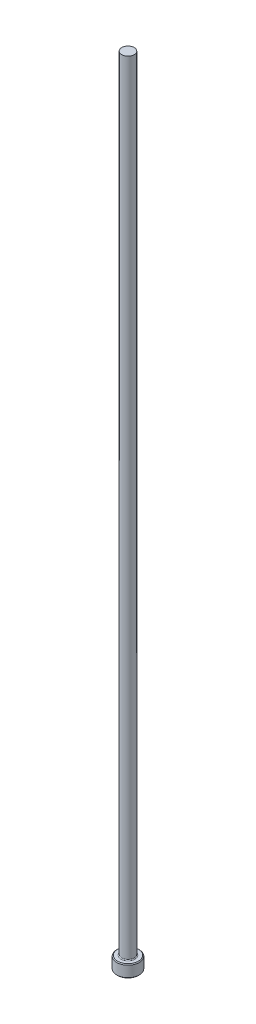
ISO-10303-21;
HEADER;
FILE_DESCRIPTION(('STEP AP214'),'2;1');
FILE_NAME('part.step','',(''),(''),'','','');
FILE_SCHEMA(('AUTOMOTIVE_DESIGN { 1 0 10303 214 1 1 1 1 }'));
ENDSEC;
DATA;
#1=APPLICATION_CONTEXT('core data for automotive mechanical design processes');
#2=APPLICATION_PROTOCOL_DEFINITION('international standard','automotive_design',2000,#1);
#3=PRODUCT_CONTEXT('',#1,'mechanical');
#4=PRODUCT('Part','Part','',(#3));
#5=PRODUCT_RELATED_PRODUCT_CATEGORY('part','',(#4));
#6=PRODUCT_DEFINITION_FORMATION('','',#4);
#7=PRODUCT_DEFINITION_CONTEXT('part definition',#1,'design');
#8=PRODUCT_DEFINITION('design','',#6,#7);
#9=PRODUCT_DEFINITION_SHAPE('','',#8);
#10=(LENGTH_UNIT() NAMED_UNIT(*) SI_UNIT(.MILLI.,.METRE.));
#11=(NAMED_UNIT(*) PLANE_ANGLE_UNIT() SI_UNIT($,.RADIAN.));
#12=(NAMED_UNIT(*) SI_UNIT($,.STERADIAN.) SOLID_ANGLE_UNIT());
#13=UNCERTAINTY_MEASURE_WITH_UNIT(LENGTH_MEASURE(1.E-05),#10,'distance_accuracy_value','');
#14=(GEOMETRIC_REPRESENTATION_CONTEXT(3) GLOBAL_UNCERTAINTY_ASSIGNED_CONTEXT((#13)) GLOBAL_UNIT_ASSIGNED_CONTEXT((#10,
#11,#12)) REPRESENTATION_CONTEXT('',''));
#15=CARTESIAN_POINT('',(0.,0.,0.));
#16=DIRECTION('',(0.,0.,1.));
#17=DIRECTION('',(1.,0.,0.));
#18=AXIS2_PLACEMENT_3D('',#15,#16,#17);
#19=CARTESIAN_POINT('',(0.,0.,0.));
#20=DIRECTION('',(0.,-1.,0.));
#21=DIRECTION('',(0.,0.,-1.));
#22=AXIS2_PLACEMENT_3D('',#19,#20,#21);
#23=PLANE('',#22);
#24=CARTESIAN_POINT('',(0.,0.,0.));
#25=DIRECTION('',(0.,-1.,0.));
#26=DIRECTION('',(0.,0.,-1.));
#27=AXIS2_PLACEMENT_3D('',#24,#25,#26);
#28=CIRCLE('',#27,3.31469999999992);
#29=CARTESIAN_POINT('',(0.,0.,-3.31469999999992));
#30=VERTEX_POINT('',#29);
#31=EDGE_CURVE('E46',#30,#30,#28,.T.);
#32=ORIENTED_EDGE('',*,*,#31,.T.);
#33=EDGE_LOOP('',(#32));
#34=FACE_BOUND('',#33,.T.);
#35=ADVANCED_FACE('F35',(#34),#23,.T.);
#36=CARTESIAN_POINT('',(0.,259.958771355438,0.));
#37=DIRECTION('',(0.,1.,0.));
#38=DIRECTION('',(0.,0.,1.));
#39=AXIS2_PLACEMENT_3D('',#36,#37,#38);
#40=CYLINDRICAL_SURFACE('',#39,3.56869999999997);
#41=CARTESIAN_POINT('',(0.,3.7084,0.));
#42=DIRECTION('',(0.,1.,0.));
#43=DIRECTION('',(0.,0.,1.));
#44=AXIS2_PLACEMENT_3D('',#41,#42,#43);
#45=CIRCLE('',#44,3.56869999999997);
#46=CARTESIAN_POINT('',(0.,3.7084,3.56869999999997));
#47=VERTEX_POINT('',#46);
#48=EDGE_CURVE('E50',#47,#47,#45,.F.);
#49=ORIENTED_EDGE('',*,*,#48,.T.);
#50=EDGE_LOOP('',(#49));
#51=FACE_BOUND('',#50,.T.);
#52=CARTESIAN_POINT('',(0.,0.254000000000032,0.));
#53=DIRECTION('',(0.,-1.,0.));
#54=DIRECTION('',(0.,0.,-1.));
#55=AXIS2_PLACEMENT_3D('',#52,#53,#54);
#56=CIRCLE('',#55,3.56869999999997);
#57=CARTESIAN_POINT('',(0.,0.254000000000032,-3.56869999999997));
#58=VERTEX_POINT('',#57);
#59=EDGE_CURVE('E55',#58,#58,#56,.F.);
#60=ORIENTED_EDGE('',*,*,#59,.T.);
#61=EDGE_LOOP('',(#60));
#62=FACE_BOUND('',#61,.T.);
#63=ADVANCED_FACE('F77',(#51,#62),#40,.T.);
#64=CARTESIAN_POINT('',(-3.56869999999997,3.9624,0.));
#65=DIRECTION('',(0.,1.,0.));
#66=DIRECTION('',(0.,0.,1.));
#67=AXIS2_PLACEMENT_3D('',#64,#65,#66);
#68=PLANE('',#67);
#69=CARTESIAN_POINT('',(0.,3.9624,0.));
#70=DIRECTION('',(0.,1.,0.));
#71=DIRECTION('',(0.,0.,1.));
#72=AXIS2_PLACEMENT_3D('',#69,#70,#71);
#73=CIRCLE('',#72,2.23773999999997);
#74=CARTESIAN_POINT('',(0.,3.9624,2.23773999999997));
#75=VERTEX_POINT('',#74);
#76=EDGE_CURVE('E10',#75,#75,#73,.F.);
#77=ORIENTED_EDGE('',*,*,#76,.T.);
#78=EDGE_LOOP('',(#77));
#79=FACE_BOUND('',#78,.T.);
#80=CARTESIAN_POINT('',(0.,3.9624,0.));
#81=DIRECTION('',(0.,1.,0.));
#82=DIRECTION('',(0.,0.,1.));
#83=AXIS2_PLACEMENT_3D('',#80,#81,#82);
#84=CIRCLE('',#83,3.31469999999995);
#85=CARTESIAN_POINT('',(0.,3.9624,3.31469999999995));
#86=VERTEX_POINT('',#85);
#87=EDGE_CURVE('E58',#86,#86,#84,.T.);
#88=ORIENTED_EDGE('',*,*,#87,.T.);
#89=EDGE_LOOP('',(#88));
#90=FACE_BOUND('',#89,.T.);
#91=ADVANCED_FACE('F69',(#79,#90),#68,.T.);
#92=CARTESIAN_POINT('',(0.,259.958771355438,0.));
#93=DIRECTION('',(0.,1.,0.));
#94=DIRECTION('',(0.,0.,1.));
#95=AXIS2_PLACEMENT_3D('',#92,#93,#94);
#96=CYLINDRICAL_SURFACE('',#95,1.98373999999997);
#97=CARTESIAN_POINT('',(0.,4.21640000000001,0.));
#98=DIRECTION('',(0.,1.,0.));
#99=DIRECTION('',(0.,0.,1.));
#100=AXIS2_PLACEMENT_3D('',#97,#98,#99);
#101=CIRCLE('',#100,1.98373999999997);
#102=CARTESIAN_POINT('',(0.,4.21640000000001,1.98373999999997));
#103=VERTEX_POINT('',#102);
#104=EDGE_CURVE('E42',#103,#103,#101,.T.);
#105=ORIENTED_EDGE('',*,*,#104,.T.);
#106=EDGE_LOOP('',(#105));
#107=FACE_BOUND('',#106,.T.);
#108=CARTESIAN_POINT('',(0.,254.,0.));
#109=DIRECTION('',(0.,1.,0.));
#110=DIRECTION('',(0.,0.,1.));
#111=AXIS2_PLACEMENT_3D('',#108,#109,#110);
#112=CIRCLE('',#111,1.98373999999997);
#113=CARTESIAN_POINT('',(0.,254.,1.98373999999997));
#114=VERTEX_POINT('',#113);
#115=EDGE_CURVE('E61',#114,#114,#112,.T.);
#116=ORIENTED_EDGE('',*,*,#115,.F.);
#117=EDGE_LOOP('',(#116));
#118=FACE_BOUND('',#117,.T.);
#119=ADVANCED_FACE('F67',(#107,#118),#96,.T.);
#120=CARTESIAN_POINT('',(-1.98373999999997,254.,0.));
#121=DIRECTION('',(0.,1.,0.));
#122=DIRECTION('',(0.,0.,1.));
#123=AXIS2_PLACEMENT_3D('',#120,#121,#122);
#124=PLANE('',#123);
#125=ORIENTED_EDGE('',*,*,#115,.T.);
#126=EDGE_LOOP('',(#125));
#127=FACE_BOUND('',#126,.T.);
#128=ADVANCED_FACE('F65',(#127),#124,.T.);
#129=CARTESIAN_POINT('',(0.,3.96239999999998,0.));
#130=DIRECTION('',(0.,-1.,0.));
#131=DIRECTION('',(0.,0.,-1.));
#132=AXIS2_PLACEMENT_3D('',#129,#130,#131);
#133=CONICAL_SURFACE('',#132,3.31469999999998,0.78539816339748);
#134=ORIENTED_EDGE('',*,*,#48,.F.);
#135=EDGE_LOOP('',(#134));
#136=FACE_BOUND('',#135,.T.);
#137=ORIENTED_EDGE('',*,*,#87,.F.);
#138=EDGE_LOOP('',(#137));
#139=FACE_BOUND('',#138,.T.);
#140=ADVANCED_FACE('F75',(#136,#139),#133,.T.);
#141=CARTESIAN_POINT('',(0.,0.254000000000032,0.));
#142=DIRECTION('',(0.,1.,0.));
#143=DIRECTION('',(0.,0.,1.));
#144=AXIS2_PLACEMENT_3D('',#141,#142,#143);
#145=CONICAL_SURFACE('',#144,3.56869999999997,0.78539816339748);
#146=ORIENTED_EDGE('',*,*,#31,.F.);
#147=EDGE_LOOP('',(#146));
#148=FACE_BOUND('',#147,.T.);
#149=ORIENTED_EDGE('',*,*,#59,.F.);
#150=EDGE_LOOP('',(#149));
#151=FACE_BOUND('',#150,.T.);
#152=ADVANCED_FACE('F89',(#148,#151),#145,.T.);
#153=CARTESIAN_POINT('',(0.,4.21640000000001,0.));
#154=DIRECTION('',(0.,1.,0.));
#155=DIRECTION('',(0.,0.,1.));
#156=AXIS2_PLACEMENT_3D('',#153,#154,#155);
#157=TOROIDAL_SURFACE('',#156,2.23773999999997,0.254);
#158=ORIENTED_EDGE('',*,*,#76,.F.);
#159=EDGE_LOOP('',(#158));
#160=FACE_BOUND('',#159,.T.);
#161=ORIENTED_EDGE('',*,*,#104,.F.);
#162=EDGE_LOOP('',(#161));
#163=FACE_BOUND('',#162,.T.);
#164=ADVANCED_FACE('F37',(#160,#163),#157,.F.);
#165=CLOSED_SHELL('',(#35,#63,#91,#119,#128,#140,#152,#164));
#166=MANIFOLD_SOLID_BREP('B2',#165);
#167=ADVANCED_BREP_SHAPE_REPRESENTATION('',(#18,#166),#14);
#168=SHAPE_DEFINITION_REPRESENTATION(#9,#167);
ENDSEC;
END-ISO-10303-21;
